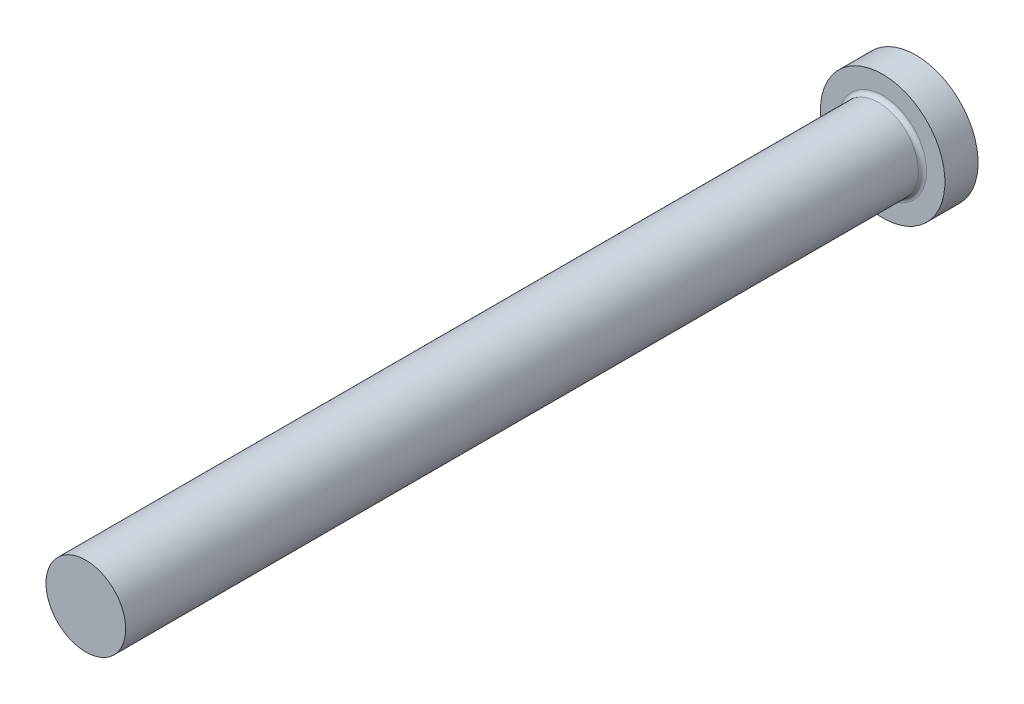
ISO-10303-21;
HEADER;
FILE_DESCRIPTION(('STEP AP214'),'2;1');
FILE_NAME('part.step','',(''),(''),'','','');
FILE_SCHEMA(('AUTOMOTIVE_DESIGN { 1 0 10303 214 1 1 1 1 }'));
ENDSEC;
DATA;
#1=APPLICATION_CONTEXT('core data for automotive mechanical design processes');
#2=APPLICATION_PROTOCOL_DEFINITION('international standard','automotive_design',2000,#1);
#3=PRODUCT_CONTEXT('',#1,'mechanical');
#4=PRODUCT('Part','Part','',(#3));
#5=PRODUCT_RELATED_PRODUCT_CATEGORY('part','',(#4));
#6=PRODUCT_DEFINITION_FORMATION('','',#4);
#7=PRODUCT_DEFINITION_CONTEXT('part definition',#1,'design');
#8=PRODUCT_DEFINITION('design','',#6,#7);
#9=PRODUCT_DEFINITION_SHAPE('','',#8);
#10=(LENGTH_UNIT() NAMED_UNIT(*) SI_UNIT(.MILLI.,.METRE.));
#11=(NAMED_UNIT(*) PLANE_ANGLE_UNIT() SI_UNIT($,.RADIAN.));
#12=(NAMED_UNIT(*) SI_UNIT($,.STERADIAN.) SOLID_ANGLE_UNIT());
#13=UNCERTAINTY_MEASURE_WITH_UNIT(LENGTH_MEASURE(1.E-05),#10,'distance_accuracy_value','');
#14=(GEOMETRIC_REPRESENTATION_CONTEXT(3) GLOBAL_UNCERTAINTY_ASSIGNED_CONTEXT((#13)) GLOBAL_UNIT_ASSIGNED_CONTEXT((#10,
#11,#12)) REPRESENTATION_CONTEXT('',''));
#15=CARTESIAN_POINT('',(0.,0.,0.));
#16=DIRECTION('',(0.,0.,1.));
#17=DIRECTION('',(1.,0.,0.));
#18=AXIS2_PLACEMENT_3D('',#15,#16,#17);
#19=CARTESIAN_POINT('',(7.5,0.,4.));
#20=DIRECTION('',(0.,0.,-1.));
#21=DIRECTION('',(-1.,0.,0.));
#22=AXIS2_PLACEMENT_3D('',#19,#20,#21);
#23=PLANE('',#22);
#24=CARTESIAN_POINT('',(0.,0.,4.));
#25=DIRECTION('',(0.,0.,-1.));
#26=DIRECTION('',(-1.,0.,0.));
#27=AXIS2_PLACEMENT_3D('',#24,#25,#26);
#28=CIRCLE('',#27,5.30000000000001);
#29=CARTESIAN_POINT('',(-5.30000000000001,0.,4.));
#30=VERTEX_POINT('',#29);
#31=EDGE_CURVE('E40',#30,#30,#28,.T.);
#32=ORIENTED_EDGE('',*,*,#31,.T.);
#33=EDGE_LOOP('',(#32));
#34=FACE_BOUND('',#33,.T.);
#35=CARTESIAN_POINT('',(0.,0.,4.));
#36=DIRECTION('',(0.,0.,-1.));
#37=DIRECTION('',(-1.,0.,0.));
#38=AXIS2_PLACEMENT_3D('',#35,#36,#37);
#39=CIRCLE('',#38,7.5);
#40=CARTESIAN_POINT('',(-7.5,0.,4.));
#41=VERTEX_POINT('',#40);
#42=EDGE_CURVE('E44',#41,#41,#39,.T.);
#43=ORIENTED_EDGE('',*,*,#42,.F.);
#44=EDGE_LOOP('',(#43));
#45=FACE_BOUND('',#44,.T.);
#46=ADVANCED_FACE('F33',(#34,#45),#23,.F.);
#47=CARTESIAN_POINT('',(0.,0.,-9.03322817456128));
#48=DIRECTION('',(0.,0.,-1.));
#49=DIRECTION('',(-1.,0.,0.));
#50=AXIS2_PLACEMENT_3D('',#47,#48,#49);
#51=CYLINDRICAL_SURFACE('',#50,7.5);
#52=CARTESIAN_POINT('',(0.,0.,0.));
#53=DIRECTION('',(0.,0.,-1.));
#54=DIRECTION('',(-1.,0.,0.));
#55=AXIS2_PLACEMENT_3D('',#52,#53,#54);
#56=CIRCLE('',#55,7.5);
#57=CARTESIAN_POINT('',(-7.5,0.,0.));
#58=VERTEX_POINT('',#57);
#59=EDGE_CURVE('E48',#58,#58,#56,.T.);
#60=ORIENTED_EDGE('',*,*,#59,.F.);
#61=EDGE_LOOP('',(#60));
#62=FACE_BOUND('',#61,.T.);
#63=ORIENTED_EDGE('',*,*,#42,.T.);
#64=EDGE_LOOP('',(#63));
#65=FACE_BOUND('',#64,.T.);
#66=ADVANCED_FACE('F68',(#62,#65),#51,.T.);
#67=CARTESIAN_POINT('',(0.,0.,0.));
#68=DIRECTION('',(0.,0.,1.));
#69=DIRECTION('',(1.,0.,0.));
#70=AXIS2_PLACEMENT_3D('',#67,#68,#69);
#71=PLANE('',#70);
#72=ORIENTED_EDGE('',*,*,#59,.T.);
#73=EDGE_LOOP('',(#72));
#74=FACE_BOUND('',#73,.T.);
#75=ADVANCED_FACE('F61',(#74),#71,.F.);
#76=CARTESIAN_POINT('',(0.,0.,100.));
#77=DIRECTION('',(0.,0.,-1.));
#78=DIRECTION('',(-1.,0.,0.));
#79=AXIS2_PLACEMENT_3D('',#76,#77,#78);
#80=PLANE('',#79);
#81=CARTESIAN_POINT('',(0.,0.,100.));
#82=DIRECTION('',(0.,0.,-1.));
#83=DIRECTION('',(-1.,0.,0.));
#84=AXIS2_PLACEMENT_3D('',#81,#82,#83);
#85=CIRCLE('',#84,4.80000000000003);
#86=CARTESIAN_POINT('',(-4.80000000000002,0.,100.));
#87=VERTEX_POINT('',#86);
#88=EDGE_CURVE('E53',#87,#87,#85,.T.);
#89=ORIENTED_EDGE('',*,*,#88,.F.);
#90=EDGE_LOOP('',(#89));
#91=FACE_BOUND('',#90,.T.);
#92=ADVANCED_FACE('F59',(#91),#80,.F.);
#93=CARTESIAN_POINT('',(0.,0.,-9.03322817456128));
#94=DIRECTION('',(0.,0.,-1.));
#95=DIRECTION('',(-1.,0.,0.));
#96=AXIS2_PLACEMENT_3D('',#93,#94,#95);
#97=CYLINDRICAL_SURFACE('',#96,4.80000000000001);
#98=CARTESIAN_POINT('',(0.,0.,4.5));
#99=DIRECTION('',(0.,0.,-1.));
#100=DIRECTION('',(-1.,0.,0.));
#101=AXIS2_PLACEMENT_3D('',#98,#99,#100);
#102=CIRCLE('',#101,4.80000000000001);
#103=CARTESIAN_POINT('',(-4.80000000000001,0.,4.5));
#104=VERTEX_POINT('',#103);
#105=EDGE_CURVE('E10',#104,#104,#102,.F.);
#106=ORIENTED_EDGE('',*,*,#105,.T.);
#107=EDGE_LOOP('',(#106));
#108=FACE_BOUND('',#107,.T.);
#109=ORIENTED_EDGE('',*,*,#88,.T.);
#110=EDGE_LOOP('',(#109));
#111=FACE_BOUND('',#110,.T.);
#112=ADVANCED_FACE('F57',(#108,#111),#97,.T.);
#113=CARTESIAN_POINT('',(0.,0.,4.5));
#114=DIRECTION('',(0.,0.,-1.));
#115=DIRECTION('',(-1.,0.,0.));
#116=AXIS2_PLACEMENT_3D('',#113,#114,#115);
#117=TOROIDAL_SURFACE('',#116,5.30000000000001,0.5);
#118=ORIENTED_EDGE('',*,*,#105,.F.);
#119=EDGE_LOOP('',(#118));
#120=FACE_BOUND('',#119,.T.);
#121=ORIENTED_EDGE('',*,*,#31,.F.);
#122=EDGE_LOOP('',(#121));
#123=FACE_BOUND('',#122,.T.);
#124=ADVANCED_FACE('F35',(#120,#123),#117,.F.);
#125=CLOSED_SHELL('',(#46,#66,#75,#92,#112,#124));
#126=MANIFOLD_SOLID_BREP('B2',#125);
#127=ADVANCED_BREP_SHAPE_REPRESENTATION('',(#18,#126),#14);
#128=SHAPE_DEFINITION_REPRESENTATION(#9,#127);
ENDSEC;
END-ISO-10303-21;
